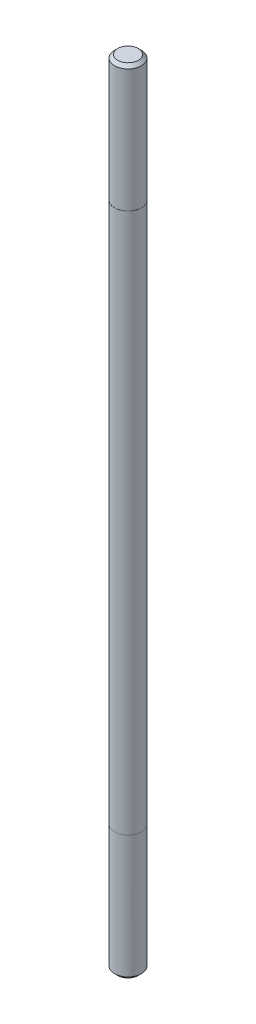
from build123d import *

# Parameters (mm, degrees)
SKETCH1_R      = 1.5
EXTRUDE1_DEPTH = 60
SKETCH2_R      = 1.49
EXTRUDE2_DEPTH = 14
EXTRUDE3_START = 14
SKETCH3_R      = 1.49
EXTRUDE3_DEPTH = 14
CHAMFER1_SIZE  = 0.35


with BuildPart() as part:
    # Sketch1 → Extrude1 (new body)
    with BuildSketch(Plane(origin=(0, 0, 0), x_dir=(1, 0, 0), z_dir=(0, 1, 0))):
        with Locations(Location((0, 0, 0), (0, 0, 270))):
            Circle(SKETCH1_R)
    extrude(amount=EXTRUDE1_DEPTH)

    # Sketch2 → Extrude2 (add)
    with BuildSketch(Plane(origin=(0, 60, 0), x_dir=(-1, 0, 0), z_dir=(0, 1, 0))):
        with Locations(Location((0, 0, 0), (0, 0, 90))):
            Circle(SKETCH2_R)
    extrude(amount=EXTRUDE2_DEPTH)

    # Sketch3 → Extrude3 (add)
    with BuildSketch(Plane.XZ.offset(EXTRUDE3_START)):
        with Locations(Location((0, 0, 0), (0, 0, 90))):
            Circle(SKETCH3_R)
    extrude(amount=-EXTRUDE3_DEPTH)

    # Chamfer1
    chamfer1_edges = [part.edges().sort_by_distance(p)[0] for p in [
        (0, -14, -1.49),
        (0, 74, -1.49),
    ]]
    chamfer(chamfer1_edges, length=CHAMFER1_SIZE)


solid = part.part
